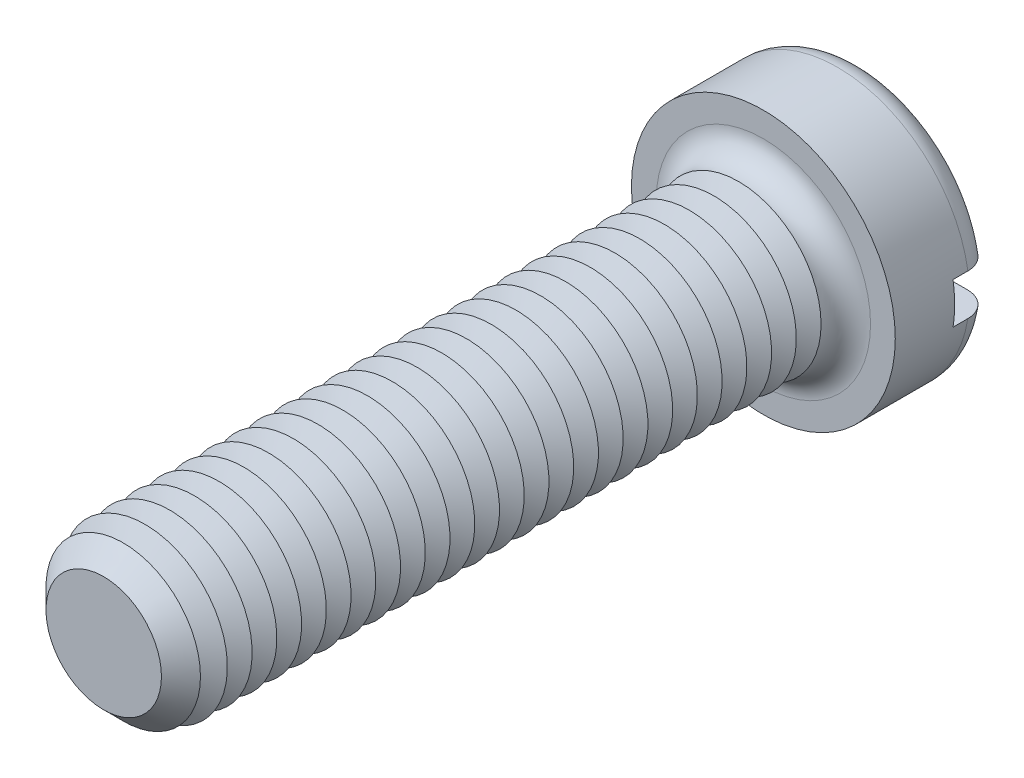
from build123d import *

# Parameters (mm, degrees)
SKETCH3_R           = 8
BOSS_EXTRUDE2_DEPTH = 6
SKETCH4_R           = 5
BOSS_EXTRUDE3_DEPTH = 40
FILLET1_R           = 1.5
CHAMFER1_SIZE       = 1.5
LPATTERN1_COUNT     = 25
LPATTERN1_PITCH     = 1.5
SKETCH8_W           = 16
SKETCH8_H           = 2.5
CUT_EXTRUDE1_DEPTH  = 2.4


with BuildPart() as part:
    # Sketch3 → Boss-Extrude2 (new body)
    with BuildSketch(Plane.XY):
        Circle(SKETCH3_R)
    extrude(amount=-BOSS_EXTRUDE2_DEPTH)

    # Sketch4 → Boss-Extrude3 (add)
    with BuildSketch(Plane.XY):
        Circle(SKETCH4_R)
    extrude(amount=BOSS_EXTRUDE3_DEPTH)

    # Fillet1
    fillet1_edges = [part.edges().sort_by_distance(p)[0] for p in [
        (-8, 0, -6),
        (-5, 0, 0),
    ]]
    fillet(fillet1_edges, radius=FILLET1_R)

    # Chamfer1
    chamfer1_edges = [part.edges().sort_by_distance(p)[0] for p in [
        (-5, 0, 40),
    ]]
    chamfer(chamfer1_edges, length=CHAMFER1_SIZE)

    # Sketch6 → Cut-Revolve1 (revolve, cut)
    with BuildSketch(Plane(origin=(0, 0, 0), x_dir=(0, 0, -1), z_dir=(1, 0, 0)), mode=Mode.PRIVATE) as cut_revolve1_sk:
        Polygon((-1.5, 5), (-2.25, 3.700961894), (-3, 5), align=None)
    cut_revolve1 = revolve(cut_revolve1_sk.sketch.rotate(Axis((0, 0, -1.694361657), (0, 0, 1)), 90), axis=Axis((0, 0, -1.694361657), (0, 0, 1)), mode=Mode.SUBTRACT)

    # LPattern1: Cut-Revolve1 ×25
    with Locations(*[(0, 0, i * LPATTERN1_PITCH) for i in range(1, LPATTERN1_COUNT)]):
        add(cut_revolve1, mode=Mode.SUBTRACT)

    # Sketch8 → Cut-Extrude1 (cut)
    with BuildSketch(Plane(origin=(0, 0, -6), x_dir=(-1, 0, 0), z_dir=(0, 0, -1))):
        Rectangle(SKETCH8_W, SKETCH8_H)
    extrude(amount=-CUT_EXTRUDE1_DEPTH, mode=Mode.SUBTRACT)


solid = part.part
